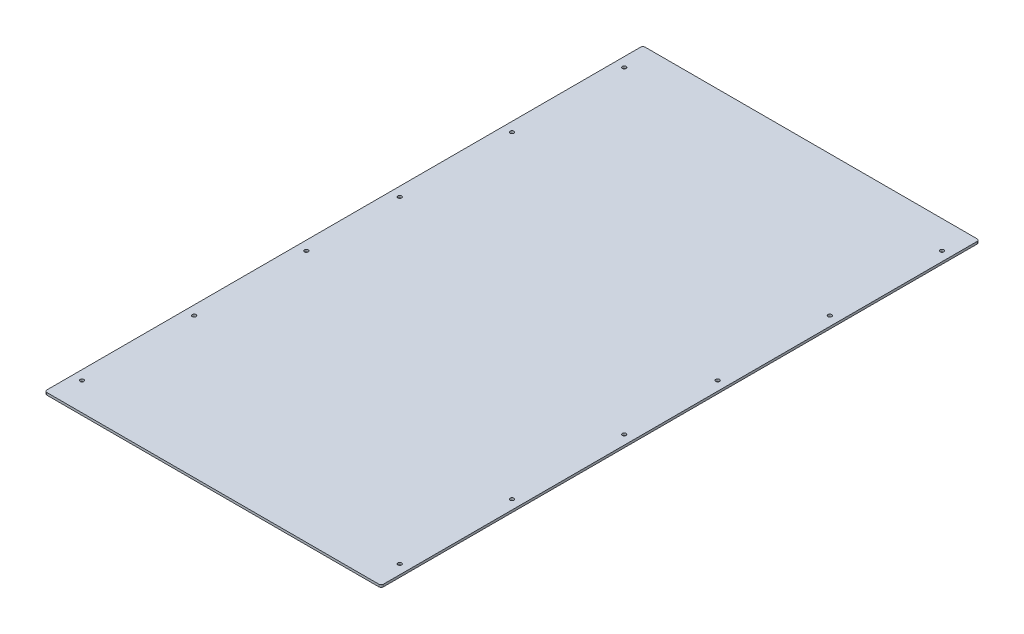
from build123d import *

# Parameters (mm, degrees)
SKETCH1_W                  = 457.2
SKETCH1_H                  = 812.8
BOSS_EXTRUDE1_DEPTH        = 3.175
F_7_0_201_DIAMETER_HOLE1_D = 5.1054
FILLET1_R                  = 3.175


with BuildPart() as part:
    # Sketch1 → Boss-Extrude1 (new body)
    with BuildSketch(Plane(origin=(0, 0, 0), x_dir=(1, 0, 0), z_dir=(0, 1, 0))):
        Rectangle(SKETCH1_W, SKETCH1_H)
    extrude(amount=BOSS_EXTRUDE1_DEPTH)

    # 7 _0.201_ Diameter Hole1 (through all)
    with Locations(Plane(origin=(0, 3.175, 0), x_dir=(1, 0, 0), z_dir=(0, 1, 0))):
        with Locations((-215.9, 368.3), (215.9, 368.3), (215.9, 215.9), (215.9, 63.5), (215.9, -63.5), (215.9, -215.9), (215.9, -368.3), (-215.9, 215.9), (-215.9, 63.5), (-215.9, -63.5), (-215.9, -215.9), (-215.9, -368.3)):
            Hole(F_7_0_201_DIAMETER_HOLE1_D / 2)

    # Fillet1
    fillet1_edges = [part.edges().sort_by_distance(p)[0] for p in [
        (228.6, 1.5875, 406.4),
        (-228.6, 1.5875, 406.4),
        (-228.6, 1.5875, -406.4),
        (228.6, 1.5875, -406.4),
    ]]
    fillet(fillet1_edges, radius=FILLET1_R)


solid = part.part
